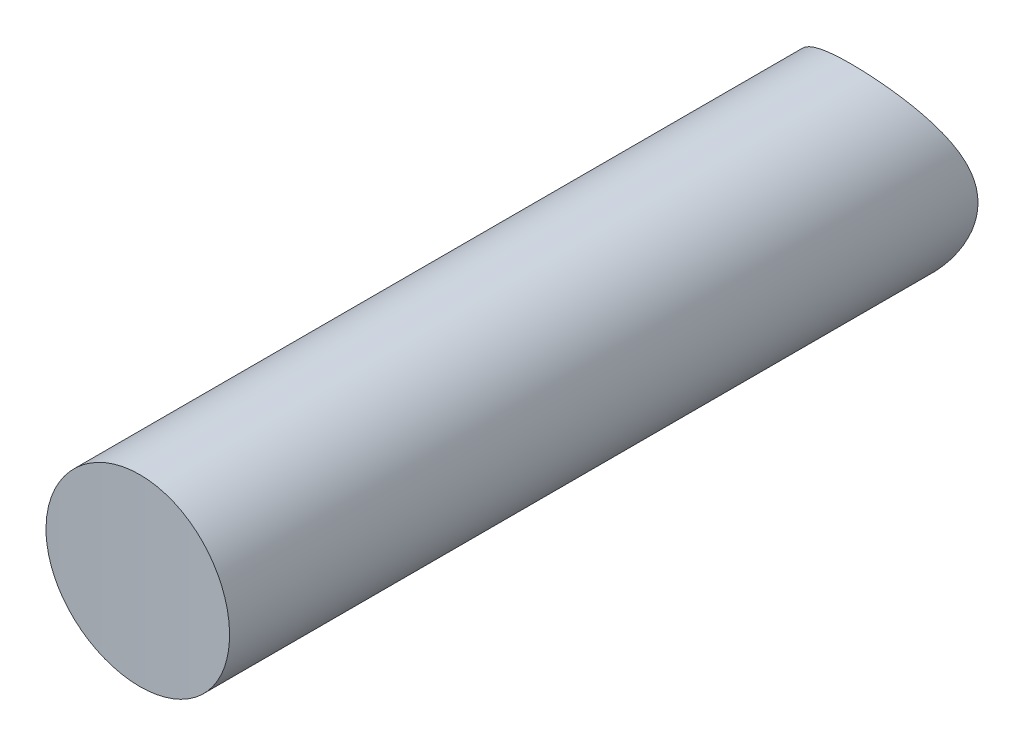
ISO-10303-21;
HEADER;
FILE_DESCRIPTION(('STEP AP214'),'2;1');
FILE_NAME('part.step','',(''),(''),'','','');
FILE_SCHEMA(('AUTOMOTIVE_DESIGN { 1 0 10303 214 1 1 1 1 }'));
ENDSEC;
DATA;
#1=APPLICATION_CONTEXT('core data for automotive mechanical design processes');
#2=APPLICATION_PROTOCOL_DEFINITION('international standard','automotive_design',2000,#1);
#3=PRODUCT_CONTEXT('',#1,'mechanical');
#4=PRODUCT('Part','Part','',(#3));
#5=PRODUCT_RELATED_PRODUCT_CATEGORY('part','',(#4));
#6=PRODUCT_DEFINITION_FORMATION('','',#4);
#7=PRODUCT_DEFINITION_CONTEXT('part definition',#1,'design');
#8=PRODUCT_DEFINITION('design','',#6,#7);
#9=PRODUCT_DEFINITION_SHAPE('','',#8);
#10=(LENGTH_UNIT() NAMED_UNIT(*) SI_UNIT(.MILLI.,.METRE.));
#11=(NAMED_UNIT(*) PLANE_ANGLE_UNIT() SI_UNIT($,.RADIAN.));
#12=(NAMED_UNIT(*) SI_UNIT($,.STERADIAN.) SOLID_ANGLE_UNIT());
#13=UNCERTAINTY_MEASURE_WITH_UNIT(LENGTH_MEASURE(1.E-05),#10,'distance_accuracy_value','');
#14=(GEOMETRIC_REPRESENTATION_CONTEXT(3) GLOBAL_UNCERTAINTY_ASSIGNED_CONTEXT((#13)) GLOBAL_UNIT_ASSIGNED_CONTEXT((#10,
#11,#12)) REPRESENTATION_CONTEXT('',''));
#15=CARTESIAN_POINT('',(0.,0.,0.));
#16=DIRECTION('',(0.,0.,1.));
#17=DIRECTION('',(1.,0.,0.));
#18=AXIS2_PLACEMENT_3D('',#15,#16,#17);
#19=CARTESIAN_POINT('',(0.,0.,70.));
#20=DIRECTION('',(0.,0.,-1.));
#21=DIRECTION('',(-1.,0.,0.));
#22=AXIS2_PLACEMENT_3D('',#19,#20,#21);
#23=CYLINDRICAL_SURFACE('',#22,4.);
#24=CARTESIAN_POINT('',(-4.,0.,34.0889328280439));
#25=CARTESIAN_POINT('',(-3.99999007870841,0.22456267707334,34.0889316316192));
#26=CARTESIAN_POINT('',(-3.98102584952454,0.449285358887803,34.0880824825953));
#27=CARTESIAN_POINT('',(-3.90564151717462,0.892533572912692,34.0847769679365));
#28=CARTESIAN_POINT('',(-3.84917708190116,1.1110514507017,34.0823187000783));
#29=CARTESIAN_POINT('',(-3.70041025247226,1.5354048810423,34.0760739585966));
#30=CARTESIAN_POINT('',(-3.60812588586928,1.74124675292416,34.0722881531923));
#31=CARTESIAN_POINT('',(-3.39036590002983,2.1344612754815,34.0638157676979));
#32=CARTESIAN_POINT('',(-3.26489820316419,2.32183831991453,34.0591294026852));
#33=CARTESIAN_POINT('',(-2.98421604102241,2.67301615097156,34.049379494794));
#34=CARTESIAN_POINT('',(-2.82898016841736,2.83679982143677,34.0443156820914));
#35=CARTESIAN_POINT('',(-2.49321003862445,3.13599612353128,34.0343840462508));
#36=CARTESIAN_POINT('',(-2.31267475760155,3.27140760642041,34.0295162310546));
#37=CARTESIAN_POINT('',(-1.93134583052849,3.51005899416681,34.0205232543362));
#38=CARTESIAN_POINT('',(-1.73054419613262,3.61328614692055,34.0163983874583));
#39=CARTESIAN_POINT('',(-1.31443895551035,3.78455662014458,34.0093587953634));
#40=CARTESIAN_POINT('',(-1.09913544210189,3.85260016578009,34.0064440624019));
#41=CARTESIAN_POINT('',(-0.660290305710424,3.9515282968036,34.0021549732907));
#42=CARTESIAN_POINT('',(-0.436754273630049,3.98243763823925,34.0007795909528));
#43=CARTESIAN_POINT('',(0.0123375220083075,4.00629633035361,33.9997207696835));
#44=CARTESIAN_POINT('',(0.23789327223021,3.99924593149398,34.0000373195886));
#45=CARTESIAN_POINT('',(0.684454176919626,3.94740589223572,34.0023258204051));
#46=CARTESIAN_POINT('',(0.905462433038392,3.90264291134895,34.0042966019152));
#47=CARTESIAN_POINT('',(1.33682459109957,3.77668967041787,34.009670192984));
#48=CARTESIAN_POINT('',(1.54717845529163,3.69549928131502,34.0130730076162));
#49=CARTESIAN_POINT('',(1.95134654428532,3.49896545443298,34.0209293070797));
#50=CARTESIAN_POINT('',(2.14515484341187,3.38360984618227,34.0253831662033));
#51=CARTESIAN_POINT('',(2.51066548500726,3.12202902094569,34.0348398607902));
#52=CARTESIAN_POINT('',(2.68236770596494,2.97580363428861,34.0398426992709));
#53=CARTESIAN_POINT('',(2.99894764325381,2.65648328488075,34.0498389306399));
#54=CARTESIAN_POINT('',(3.14380203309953,2.48336519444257,34.0548323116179));
#55=CARTESIAN_POINT('',(3.40239477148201,2.11525496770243,34.0642423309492));
#56=CARTESIAN_POINT('',(3.5161331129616,1.92026282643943,34.0686589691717));
#57=CARTESIAN_POINT('',(3.7092629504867,1.51392582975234,34.0764171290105));
#58=CARTESIAN_POINT('',(3.78865360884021,1.30258057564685,34.0797586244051));
#59=CARTESIAN_POINT('',(3.91081907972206,0.869542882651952,34.0849886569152));
#60=CARTESIAN_POINT('',(3.95359410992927,0.647850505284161,34.0868772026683));
#61=CARTESIAN_POINT('',(4.00128532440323,0.200614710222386,34.0889867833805));
#62=CARTESIAN_POINT('',(4.0062338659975,-0.0249252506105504,34.08920924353));
#63=CARTESIAN_POINT('',(3.97821603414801,-0.473632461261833,34.0879652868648));
#64=CARTESIAN_POINT('',(3.94524975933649,-0.696799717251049,34.0864988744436));
#65=CARTESIAN_POINT('',(3.84236490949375,-1.13433593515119,34.0820437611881));
#66=CARTESIAN_POINT('',(3.77246111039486,-1.3487083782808,34.0790556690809));
#67=CARTESIAN_POINT('',(3.59770048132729,-1.76267686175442,34.0718945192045));
#68=CARTESIAN_POINT('',(3.49284349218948,-1.96227283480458,34.0677214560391));
#69=CARTESIAN_POINT('',(3.25106981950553,-2.34117151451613,34.0586572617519));
#70=CARTESIAN_POINT('',(3.11413138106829,-2.52046032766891,34.0537656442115));
#71=CARTESIAN_POINT('',(2.81211382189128,-2.85351564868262,34.0438174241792));
#72=CARTESIAN_POINT('',(2.64703455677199,-3.00728202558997,34.0387608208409));
#73=CARTESIAN_POINT('',(2.29328248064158,-3.28503611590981,34.0290484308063));
#74=CARTESIAN_POINT('',(2.1045932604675,-3.40900294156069,34.0243929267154));
#75=CARTESIAN_POINT('',(1.70906061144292,-3.62349619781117,34.0160114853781));
#76=CARTESIAN_POINT('',(1.50221724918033,-3.71402275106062,34.0122855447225));
#77=CARTESIAN_POINT('',(1.07632588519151,-3.85902916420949,34.0061845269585));
#78=CARTESIAN_POINT('',(0.857282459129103,-3.91352244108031,34.0038089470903));
#79=CARTESIAN_POINT('',(0.413144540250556,-3.98495939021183,34.00067439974));
#80=CARTESIAN_POINT('',(0.188050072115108,-4.00190321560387,33.9999154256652));
#81=CARTESIAN_POINT('',(-0.261592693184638,-3.997758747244,34.0000995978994));
#82=CARTESIAN_POINT('',(-0.486141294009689,-3.97670325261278,34.0010412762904));
#83=CARTESIAN_POINT('',(-0.928512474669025,-3.89722554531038,34.0045178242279));
#84=CARTESIAN_POINT('',(-1.14633504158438,-3.83880326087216,34.0070526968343));
#85=CARTESIAN_POINT('',(-1.56907889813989,-3.68625668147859,34.0134303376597));
#86=CARTESIAN_POINT('',(-1.7740000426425,-3.5921319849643,34.0172731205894));
#87=CARTESIAN_POINT('',(-2.16513144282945,-3.37085897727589,34.025834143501));
#88=CARTESIAN_POINT('',(-2.35134230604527,-3.24371173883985,34.0305523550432));
#89=CARTESIAN_POINT('',(-2.69992918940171,-2.95988853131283,34.0403375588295));
#90=CARTESIAN_POINT('',(-2.8622871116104,-2.80319034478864,34.0454048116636));
#91=CARTESIAN_POINT('',(-3.15844084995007,-2.46471576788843,34.0553154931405));
#92=CARTESIAN_POINT('',(-3.29222961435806,-2.28293320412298,34.0601588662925));
#93=CARTESIAN_POINT('',(-3.52749678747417,-1.89933076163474,34.0690782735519));
#94=CARTESIAN_POINT('',(-3.62894741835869,-1.69749385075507,34.0731536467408));
#95=CARTESIAN_POINT('',(-3.796401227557,-1.27978639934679,34.0800665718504));
#96=CARTESIAN_POINT('',(-3.86244640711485,-1.06393282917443,34.0829055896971));
#97=CARTESIAN_POINT('',(-3.939831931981,-0.705608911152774,34.0862715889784));
#98=CARTESIAN_POINT('',(-3.96236628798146,-0.565461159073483,34.0872651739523));
#99=CARTESIAN_POINT('',(-3.99245344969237,-0.283563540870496,34.0885961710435));
#100=CARTESIAN_POINT('',(-4.00000626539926,-0.141813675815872,34.0889335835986));
#101=CARTESIAN_POINT('',(-4.,0.,34.0889328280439));
#102=B_SPLINE_CURVE_WITH_KNOTS('',3,(#24,#25,#26,#27,#28,#29,#30,#31,#32,#33,#34,#35,#36,#37,
#38,#39,#40,#41,#42,#43,#44,#45,#46,#47,#48,#49,#50,#51,#52,#53,#54,#55,#56,#57,#58,#59,#60,#61,
#62,#63,#64,#65,#66,#67,#68,#69,#70,#71,#72,#73,#74,#75,#76,#77,#78,#79,#80,#81,#82,#83,#84,#85,
#86,#87,#88,#89,#90,#91,#92,#93,#94,#95,#96,#97,#98,#99,#100,#101),.UNSPECIFIED.,.T.,.F.,(4,2,2,
2,2,2,2,2,2,2,2,2,2,2,2,2,2,2,2,2,2,2,2,2,2,2,2,2,2,2,2,2,2,2,2,2,2,2,4),(0.,0.67317036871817,
1.34713796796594,2.02076680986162,2.694234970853,3.36818927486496,4.04217086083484,
4.71641915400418,5.39066313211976,6.06445736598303,6.73824715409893,7.41156103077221,
8.08487729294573,8.75843369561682,9.43199380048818,10.1061364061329,10.780279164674,
11.4544383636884,12.1285935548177,12.8021719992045,13.475748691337,14.1490561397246,
14.8223666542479,15.4961350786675,16.1699069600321,16.84414974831,17.518390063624,
18.1923791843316,18.8663655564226,19.5397704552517,20.2131766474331,20.8865904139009,
21.5599823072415,22.2338825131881,22.9079488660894,23.5825926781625,24.2564343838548,
24.6815487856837,25.1066629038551),.UNSPECIFIED.);
#103=CARTESIAN_POINT('',(-4.,0.,34.0889328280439));
#104=VERTEX_POINT('',#103);
#105=EDGE_CURVE('E42',#104,#104,#102,.T.);
#106=ORIENTED_EDGE('',*,*,#105,.T.);
#107=EDGE_LOOP('',(#106));
#108=FACE_BOUND('',#107,.T.);
#109=CARTESIAN_POINT('',(-4.,0.,1.47213595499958));
#110=CARTESIAN_POINT('',(-3.9999997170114,-0.0976431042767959,1.47213652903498));
#111=CARTESIAN_POINT('',(-3.99641730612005,-0.195294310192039,1.47534825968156));
#112=CARTESIAN_POINT('',(-3.98216749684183,-0.389671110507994,1.48803193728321));
#113=CARTESIAN_POINT('',(-3.97149896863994,-0.486396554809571,1.4975048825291));
#114=CARTESIAN_POINT('',(-3.94327894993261,-0.678202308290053,1.52226731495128));
#115=CARTESIAN_POINT('',(-3.92571874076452,-0.773280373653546,1.53756416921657));
#116=CARTESIAN_POINT('',(-3.88403234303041,-0.961017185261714,1.57329682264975));
#117=CARTESIAN_POINT('',(-3.85990279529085,-1.05367466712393,1.59373525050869));
#118=CARTESIAN_POINT('',(-3.77874337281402,-1.32534306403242,1.66111687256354));
#119=CARTESIAN_POINT('',(-3.7126228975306,-1.50013982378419,1.71442667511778));
#120=CARTESIAN_POINT('',(-3.55867162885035,-1.83576724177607,1.83168645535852));
#121=CARTESIAN_POINT('',(-3.47083632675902,-1.99659499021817,1.89563864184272));
#122=CARTESIAN_POINT('',(-3.26005745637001,-2.32727707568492,2.03891753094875));
#123=CARTESIAN_POINT('',(-3.13377721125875,-2.49463975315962,2.11908788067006));
#124=CARTESIAN_POINT('',(-2.85635586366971,-2.80802992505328,2.27890739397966));
#125=CARTESIAN_POINT('',(-2.70519055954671,-2.95403638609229,2.35855597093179));
#126=CARTESIAN_POINT('',(-2.44937953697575,-3.16466500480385,2.47824404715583));
#127=CARTESIAN_POINT('',(-2.35243673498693,-3.23741444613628,2.52067267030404));
#128=CARTESIAN_POINT('',(-2.15136155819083,-3.37437812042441,2.60208782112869));
#129=CARTESIAN_POINT('',(-2.04723227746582,-3.43859599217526,2.64107581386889));
#130=CARTESIAN_POINT('',(-1.83234219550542,-3.55775319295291,2.71449118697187));
#131=CARTESIAN_POINT('',(-1.72158518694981,-3.6126977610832,2.74892114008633));
#132=CARTESIAN_POINT('',(-1.49410810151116,-3.71255422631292,2.81219111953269));
#133=CARTESIAN_POINT('',(-1.37738930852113,-3.75746827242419,2.84103234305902));
#134=CARTESIAN_POINT('',(-1.15232476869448,-3.83204713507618,2.88930150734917));
#135=CARTESIAN_POINT('',(-1.04450655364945,-3.86285681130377,2.90942214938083));
#136=CARTESIAN_POINT('',(-0.825799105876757,-3.91544356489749,2.94392998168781));
#137=CARTESIAN_POINT('',(-0.714910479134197,-3.93722241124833,2.95831829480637));
#138=CARTESIAN_POINT('',(-0.491177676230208,-3.97133949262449,2.98091750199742));
#139=CARTESIAN_POINT('',(-0.378335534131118,-3.98368700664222,2.98913446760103));
#140=CARTESIAN_POINT('',(-0.151731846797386,-3.99873296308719,2.99915267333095));
#141=CARTESIAN_POINT('',(-0.0379704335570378,-4.00143276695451,3.0009548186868));
#142=CARTESIAN_POINT('',(0.171941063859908,-3.99746401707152,2.99830969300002));
#143=CARTESIAN_POINT('',(0.268132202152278,-3.99216085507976,2.99477321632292));
#144=CARTESIAN_POINT('',(0.459637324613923,-3.97466734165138,2.98313776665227));
#145=CARTESIAN_POINT('',(0.554951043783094,-3.96247497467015,2.97503745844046));
#146=CARTESIAN_POINT('',(0.743961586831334,-3.93137237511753,2.95445649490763));
#147=CARTESIAN_POINT('',(0.83765894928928,-3.91246442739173,2.94197732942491));
#148=CARTESIAN_POINT('',(1.02287485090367,-3.86817911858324,2.91291254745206));
#149=CARTESIAN_POINT('',(1.11439253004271,-3.84279924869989,2.8963253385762));
#150=CARTESIAN_POINT('',(1.38404430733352,-3.75762944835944,2.84105189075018));
#151=CARTESIAN_POINT('',(1.55823034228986,-3.6886486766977,2.79674494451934));
#152=CARTESIAN_POINT('',(1.89244921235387,-3.52888626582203,2.69641870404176));
#153=CARTESIAN_POINT('',(2.05247945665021,-3.43810064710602,2.64039727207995));
#154=CARTESIAN_POINT('',(2.37655495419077,-3.22404814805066,2.5123651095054));
#155=CARTESIAN_POINT('',(2.53836442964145,-3.09808066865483,2.43922063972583));
#156=CARTESIAN_POINT('',(2.83999471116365,-2.82418690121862,2.28799955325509));
#157=CARTESIAN_POINT('',(2.97978090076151,-2.67622674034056,2.20991543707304));
#158=CARTESIAN_POINT('',(3.1815701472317,-2.42721574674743,2.08773984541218));
#159=CARTESIAN_POINT('',(3.25150721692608,-2.33271227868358,2.04320645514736));
#160=CARTESIAN_POINT('',(3.38312626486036,-2.1373703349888,1.95587543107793));
#161=CARTESIAN_POINT('',(3.44480638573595,-2.03653044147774,1.91307818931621));
#162=CARTESIAN_POINT('',(3.61662345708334,-1.72512860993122,1.78955438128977));
#163=CARTESIAN_POINT('',(3.7139376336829,-1.5051935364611,1.71344096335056));
#164=CARTESIAN_POINT('',(3.84666645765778,-1.11053791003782,1.60525059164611));
#165=CARTESIAN_POINT('',(3.89181903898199,-0.94080684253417,1.56680546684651));
#166=CARTESIAN_POINT('',(3.9595879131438,-0.593927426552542,1.50818261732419));
#167=CARTESIAN_POINT('',(3.98224328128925,-0.41679249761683,1.48797322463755));
#168=CARTESIAN_POINT('',(4.00358886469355,-0.0591122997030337,1.46895064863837));
#169=CARTESIAN_POINT('',(4.00217482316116,0.121444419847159,1.47023054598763));
#170=CARTESIAN_POINT('',(3.97523236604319,0.479367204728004,1.49419773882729));
#171=CARTESIAN_POINT('',(3.94968440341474,0.656730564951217,1.51690238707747));
#172=CARTESIAN_POINT('',(3.87799627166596,0.994778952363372,1.57855951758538));
#173=CARTESIAN_POINT('',(3.83292347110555,1.15585545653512,1.61666373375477));
#174=CARTESIAN_POINT('',(3.72446085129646,1.46825243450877,1.70459917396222));
#175=CARTESIAN_POINT('',(3.66106488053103,1.61956961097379,1.75443433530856));
#176=CARTESIAN_POINT('',(3.50326678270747,1.9404040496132,1.87222968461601));
#177=CARTESIAN_POINT('',(3.40519994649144,2.10751375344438,1.94182168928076));
#178=CARTESIAN_POINT('',(3.18705526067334,2.42483347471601,2.08525023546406));
#179=CARTESIAN_POINT('',(3.06695061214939,2.57502255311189,2.1590918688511));
#180=CARTESIAN_POINT('',(2.77753026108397,2.8879252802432,2.32151384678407));
#181=CARTESIAN_POINT('',(2.60319582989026,3.04620809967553,2.4097901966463));
#182=CARTESIAN_POINT('',(2.22621086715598,3.33163096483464,2.57551048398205));
#183=CARTESIAN_POINT('',(2.02358560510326,3.45879852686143,2.65296396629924));
#184=CARTESIAN_POINT('',(1.63493887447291,3.65579076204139,2.77581992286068));
#185=CARTESIAN_POINT('',(1.45320204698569,3.73193778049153,2.82452105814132));
#186=CARTESIAN_POINT('',(1.17138183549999,3.82592544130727,2.88533352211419));
#187=CARTESIAN_POINT('',(1.07589158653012,3.85388507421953,2.90356620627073));
#188=CARTESIAN_POINT('',(0.882402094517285,3.90273054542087,2.9355674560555));
#189=CARTESIAN_POINT('',(0.784403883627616,3.92361924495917,2.9493378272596));
#190=CARTESIAN_POINT('',(0.58608627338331,3.95811641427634,2.97214517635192));
#191=CARTESIAN_POINT('',(0.485757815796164,3.97168850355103,2.98115849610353));
#192=CARTESIAN_POINT('',(0.284073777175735,3.99118530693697,2.99412268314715));
#193=CARTESIAN_POINT('',(0.182718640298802,3.99711319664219,2.99807565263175));
#194=CARTESIAN_POINT('',(-0.0202340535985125,4.00123655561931,3.00082424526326));
#195=CARTESIAN_POINT('',(-0.121831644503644,3.99943087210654,2.99961909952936));
#196=CARTESIAN_POINT('',(-0.324399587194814,3.98811428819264,2.99208126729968));
#197=CARTESIAN_POINT('',(-0.425369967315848,3.97860373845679,2.98574881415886));
#198=CARTESIAN_POINT('',(-0.618542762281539,3.95299767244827,2.96876081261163));
#199=CARTESIAN_POINT('',(-0.710846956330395,3.93743382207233,2.9584547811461));
#200=CARTESIAN_POINT('',(-0.893633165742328,3.9000175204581,2.93379662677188));
#201=CARTESIAN_POINT('',(-0.984114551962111,3.87816293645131,2.9194431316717));
#202=CARTESIAN_POINT('',(-1.25193819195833,3.80354102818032,2.87073041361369));
#203=CARTESIAN_POINT('',(-1.42581956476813,3.74169386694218,2.83070421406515));
#204=CARTESIAN_POINT('',(-1.77032329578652,3.59211762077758,2.73583289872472));
#205=CARTESIAN_POINT('',(-1.94017490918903,3.50309800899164,2.68026433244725));
#206=CARTESIAN_POINT('',(-2.26309758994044,3.30370008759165,2.55950881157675));
#207=CARTESIAN_POINT('',(-2.41615853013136,3.19330899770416,2.49431610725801));
#208=CARTESIAN_POINT('',(-2.72659100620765,2.93474157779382,2.3478584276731));
#209=CARTESIAN_POINT('',(-2.88085428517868,2.78335313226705,2.26567827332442));
#210=CARTESIAN_POINT('',(-3.16319975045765,2.45777373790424,2.10106715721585));
#211=CARTESIAN_POINT('',(-3.29126235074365,2.28356588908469,2.0186360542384));
#212=CARTESIAN_POINT('',(-3.51026526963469,1.92826235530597,1.86768444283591));
#213=CARTESIAN_POINT('',(-3.60329311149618,1.74870760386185,1.79858239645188));
#214=CARTESIAN_POINT('',(-3.76231587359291,1.37343986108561,1.67494937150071));
#215=CARTESIAN_POINT('',(-3.82836331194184,1.17775916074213,1.62039015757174));
#216=CARTESIAN_POINT('',(-3.91872563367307,0.818431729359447,1.54382295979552));
#217=CARTESIAN_POINT('',(-3.94904582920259,0.657298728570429,1.51728034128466));
#218=CARTESIAN_POINT('',(-3.9795333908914,0.412440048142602,1.49037557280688));
#219=CARTESIAN_POINT('',(-3.98719713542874,0.330287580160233,1.48355881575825));
#220=CARTESIAN_POINT('',(-3.99742989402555,0.165425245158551,1.47443935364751));
#221=CARTESIAN_POINT('',(-4.0000002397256,0.082715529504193,1.4721354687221));
#222=CARTESIAN_POINT('',(-4.,0.,1.47213595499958));
#223=B_SPLINE_CURVE_WITH_KNOTS('',3,(#109,#110,#111,#112,#113,#114,#115,#116,#117,#118,#119,
#120,#121,#122,#123,#124,#125,#126,#127,#128,#129,#130,#131,#132,#133,#134,#135,#136,#137,#138,
#139,#140,#141,#142,#143,#144,#145,#146,#147,#148,#149,#150,#151,#152,#153,#154,#155,#156,#157,
#158,#159,#160,#161,#162,#163,#164,#165,#166,#167,#168,#169,#170,#171,#172,#173,#174,#175,#176,
#177,#178,#179,#180,#181,#182,#183,#184,#185,#186,#187,#188,#189,#190,#191,#192,#193,#194,#195,
#196,#197,#198,#199,#200,#201,#202,#203,#204,#205,#206,#207,#208,#209,#210,#211,#212,#213,#214,
#215,#216,#217,#218,#219,#220,#221,#222),.UNSPECIFIED.,.T.,.F.,(4,2,2,2,2,2,2,2,2,2,2,2,2,2,2,2,
2,2,2,2,2,2,2,2,2,2,2,2,2,2,2,2,2,2,2,2,2,2,2,2,2,2,2,2,2,2,2,2,2,2,2,2,2,2,2,2,4),(0.,
0.292826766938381,0.585700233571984,0.878945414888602,1.17234082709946,1.75280804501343,
2.33339588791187,3.00435628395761,3.6759731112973,4.06076920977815,4.44540065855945,
4.82981407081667,5.21414504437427,5.55540517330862,5.89659842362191,6.23745555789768,
6.57826459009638,6.86712000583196,7.15605997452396,7.44490173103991,7.7338556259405,
8.30887949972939,8.88400839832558,9.53471337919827,10.1864311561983,10.5631761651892,
10.9400057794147,11.6916411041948,12.2289535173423,12.7653310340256,13.3040324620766,
13.8431705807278,14.3559607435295,14.8689232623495,15.4844163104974,16.1006628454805,
16.8515253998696,17.6017215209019,18.2078433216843,18.5109911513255,18.814016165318,
19.1185343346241,19.4229259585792,19.727362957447,20.0317861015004,20.313975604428,
20.5962608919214,21.1603518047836,21.7570825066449,22.3541711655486,23.0451693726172,
23.7366822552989,24.3754077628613,25.0128839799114,25.509057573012,25.757182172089,
26.0052418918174),.UNSPECIFIED.);
#224=CARTESIAN_POINT('',(-4.,0.,1.47213595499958));
#225=VERTEX_POINT('',#224);
#226=EDGE_CURVE('E10',#225,#225,#223,.T.);
#227=ORIENTED_EDGE('',*,*,#226,.T.);
#228=EDGE_LOOP('',(#227));
#229=FACE_BOUND('',#228,.T.);
#230=ADVANCED_FACE('F32',(#108,#229),#23,.T.);
#231=CARTESIAN_POINT('',(0.,-4.,124.));
#232=DIRECTION('',(0.,1.,0.));
#233=DIRECTION('',(0.,0.,1.));
#234=AXIS2_PLACEMENT_3D('',#231,#232,#233);
#235=CYLINDRICAL_SURFACE('',#234,90.);
#236=ORIENTED_EDGE('',*,*,#105,.F.);
#237=EDGE_LOOP('',(#236));
#238=FACE_BOUND('',#237,.T.);
#239=ADVANCED_FACE('F50',(#238),#235,.F.);
#240=CARTESIAN_POINT('',(0.,-4.,-3.));
#241=DIRECTION('',(0.,1.,0.));
#242=DIRECTION('',(0.,0.,1.));
#243=AXIS2_PLACEMENT_3D('',#240,#241,#242);
#244=CYLINDRICAL_SURFACE('',#243,6.);
#245=ORIENTED_EDGE('',*,*,#226,.F.);
#246=EDGE_LOOP('',(#245));
#247=FACE_BOUND('',#246,.T.);
#248=ADVANCED_FACE('F53',(#247),#244,.F.);
#249=CLOSED_SHELL('',(#230,#239,#248));
#250=MANIFOLD_SOLID_BREP('B2',#249);
#251=ADVANCED_BREP_SHAPE_REPRESENTATION('',(#18,#250),#14);
#252=SHAPE_DEFINITION_REPRESENTATION(#9,#251);
ENDSEC;
END-ISO-10303-21;
